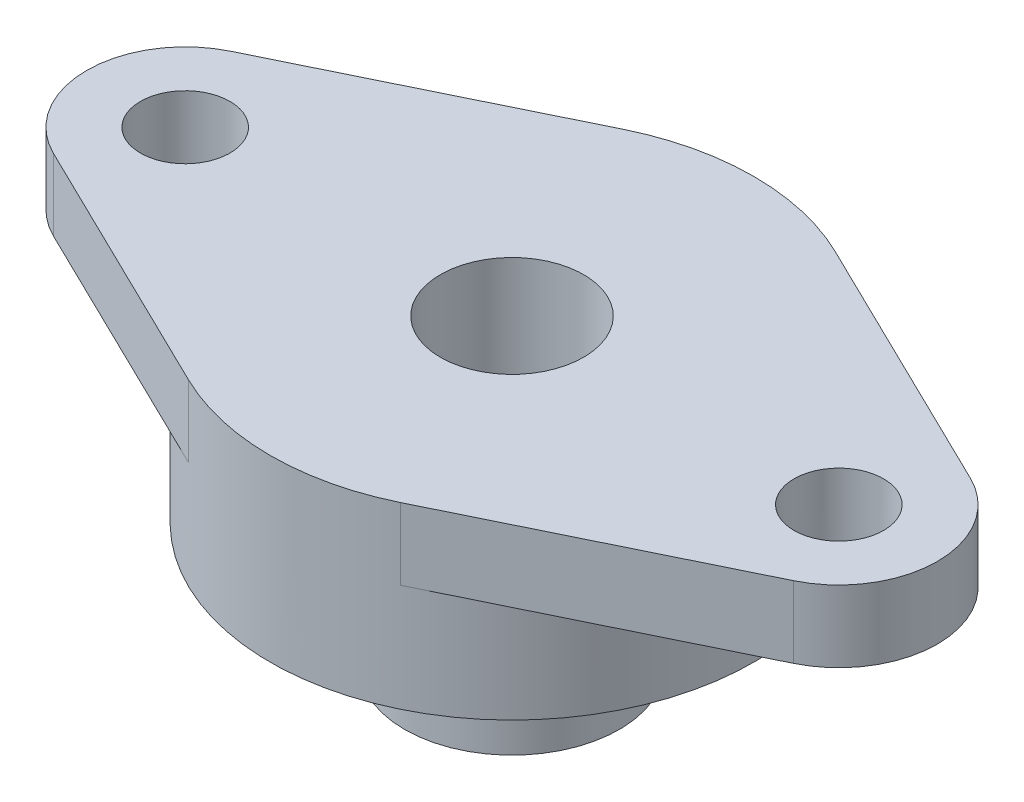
from build123d import *

# Parameters (mm, degrees)
SALIENTE_EXTRUIR1_DEPTH             = 4
SALIENTE_EXTRUIR2_START             = 6
CROQUIS2_R                          = 13.5
SALIENTE_EXTRUIR2_DEPTH             = 6
DI_METRO_DE_TALADRO_23_0_23_1_D     = 23
DI_METRO_DE_TALADRO_23_0_23_1_DEPTH = 2
CROQUIS5_W                          = 6
CROQUIS5_H                          = 9
DI_METRO_DE_TALADRO_8_0_8_1_D       = 8
CROQUIS8_W                          = 1.25
CROQUIS8_H                          = 19.950328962
CROQUIS10_W                         = 1.25
CROQUIS10_H                         = 9.700328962
DI_METRO_DE_TALADRO_5_0_5_1_D       = 5
DI_METRO_DE_TALADRO_5_0_5_1_DEPTH   = 17
DI_METRO_DE_TALADRO_5_0_5_2_D       = 5


with BuildPart() as part:
    # Croquis1 → Saliente-Extruir1 (new body)
    with BuildSketch(Plane.XZ):
        with BuildLine():
            Line((20.660958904, 4.943407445), (5.917808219, 12.133818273))
            ThreePointArc((5.917808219, 12.133818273), (0, 13.5), (-5.917808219, 12.133818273))
            Line((-5.917808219, 12.133818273), (-20.660958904, 4.943407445))
            ThreePointArc((-20.660958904, 4.943407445), (-23.75, 0), (-20.660958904, -4.943407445))
            Line((-20.660958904, -4.943407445), (-5.917808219, -12.133818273))
            ThreePointArc((-5.917808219, -12.133818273), (0, -13.5), (5.917808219, -12.133818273))
            Line((5.917808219, -12.133818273), (20.660958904, -4.943407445))
            ThreePointArc((20.660958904, -4.943407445), (23.75, 0), (20.660958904, 4.943407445))
        make_face()
    extrude(amount=-SALIENTE_EXTRUIR1_DEPTH)

    # Croquis2 → Saliente-Extruir2 (add)
    with BuildSketch(Plane.XZ.offset(SALIENTE_EXTRUIR2_START)):
        with Locations(Location((0, 0, 0), (0, 0, 270))):
            Circle(CROQUIS2_R)
    extrude(amount=-SALIENTE_EXTRUIR2_DEPTH)

    # Di_metro de taladro _23.0 _23_1
    with Locations(Plane(origin=(0, -6, 0), x_dir=(-1, 0, 0), z_dir=(0, -1, 0))):
        with Locations((0, 0)):
            Hole(DI_METRO_DE_TALADRO_23_0_23_1_D / 2, depth=DI_METRO_DE_TALADRO_23_0_23_1_DEPTH)

    # Croquis5 → Revoluci_n1 (revolve)
    with BuildSketch(Plane(origin=(0, 0, 0), x_dir=(-1, 0, 0), z_dir=(0, 0, -1)), mode=Mode.PRIVATE) as revoluci_n1_sk:
        with Locations((-3, -8.5)):
            Rectangle(CROQUIS5_W, CROQUIS5_H)
    revolve(revoluci_n1_sk.sketch.rotate(Axis((0, -13, 0), (0, 1, 0)), 90), axis=Axis((0, -13, 0), (0, 1, 0)))

    # Di_metro de taladro _8.0 _8_1 (through all)
    with Locations(Plane(origin=(0, 4, 0), x_dir=(1, 0, 0), z_dir=(0, 1, 0))):
        with Locations((0, 0)):
            Hole(DI_METRO_DE_TALADRO_8_0_8_1_D / 2)

    # Croquis8 → Di_metro de taladro _2.5 _2.5_1 (revolve, cut)
    with BuildSketch(Plane(origin=(3.799671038, -10.29269596, 0), x_dir=(0, 0, 1), z_dir=(0, 1, 0))):
        with Locations((0.625, 9.975164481)):
            Rectangle(CROQUIS8_W, CROQUIS8_H)
    revolve(axis=Axis((-2.550328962, -10.29269596, 0), (1, 0, 0)), mode=Mode.SUBTRACT)

    # Croquis10 → Di_metro de taladro _2.5 _2.5_2 (revolve, cut)
    with BuildSketch(Plane(origin=(0, -10.29269596, -3.799671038), x_dir=(0, -1, 0), z_dir=(1, 0, 0))):
        with Locations((0.625, 4.850164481)):
            Rectangle(CROQUIS10_W, CROQUIS10_H)
    revolve(axis=Axis((0, -10.29269596, 2.550328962), (0, 0, -1)), mode=Mode.SUBTRACT)

    # Di_metro de taladro _5.0 _5_1
    with Locations(Plane(origin=(0, 4, 0), x_dir=(1, 0, 0), z_dir=(0, 1, 0))):
        with Locations((18.25, 0)):
            Hole(DI_METRO_DE_TALADRO_5_0_5_1_D / 2, depth=DI_METRO_DE_TALADRO_5_0_5_1_DEPTH)

    # Di_metro de taladro _5.0 _5_2 (through all)
    with Locations(Plane(origin=(0, 0, 0), x_dir=(-1, 0, 0), z_dir=(0, -1, 0))):
        with Locations((18.25, 0)):
            Hole(DI_METRO_DE_TALADRO_5_0_5_2_D / 2)


solid = part.part
